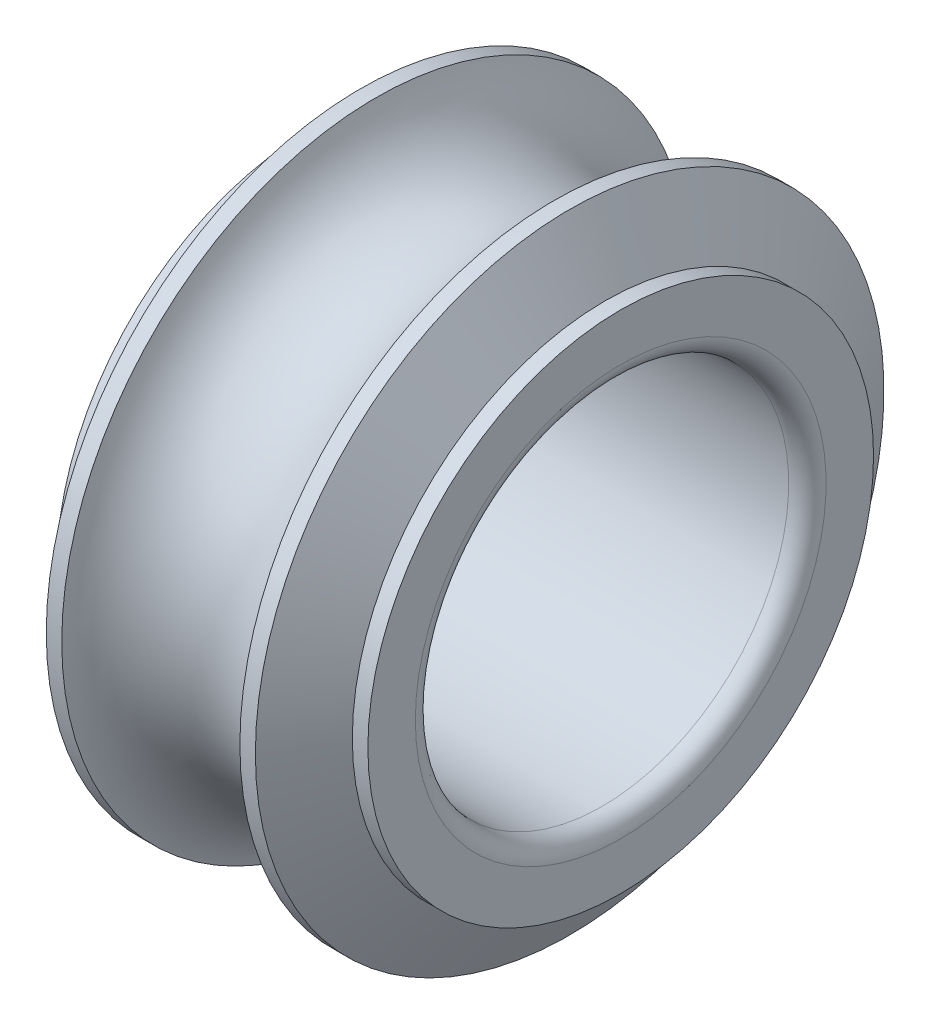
ISO-10303-21;
HEADER;
FILE_DESCRIPTION(('STEP AP214'),'2;1');
FILE_NAME('part.step','',(''),(''),'','','');
FILE_SCHEMA(('AUTOMOTIVE_DESIGN { 1 0 10303 214 1 1 1 1 }'));
ENDSEC;
DATA;
#1=APPLICATION_CONTEXT('core data for automotive mechanical design processes');
#2=APPLICATION_PROTOCOL_DEFINITION('international standard','automotive_design',2000,#1);
#3=PRODUCT_CONTEXT('',#1,'mechanical');
#4=PRODUCT('Part','Part','',(#3));
#5=PRODUCT_RELATED_PRODUCT_CATEGORY('part','',(#4));
#6=PRODUCT_DEFINITION_FORMATION('','',#4);
#7=PRODUCT_DEFINITION_CONTEXT('part definition',#1,'design');
#8=PRODUCT_DEFINITION('design','',#6,#7);
#9=PRODUCT_DEFINITION_SHAPE('','',#8);
#10=(LENGTH_UNIT() NAMED_UNIT(*) SI_UNIT(.MILLI.,.METRE.));
#11=(NAMED_UNIT(*) PLANE_ANGLE_UNIT() SI_UNIT($,.RADIAN.));
#12=(NAMED_UNIT(*) SI_UNIT($,.STERADIAN.) SOLID_ANGLE_UNIT());
#13=UNCERTAINTY_MEASURE_WITH_UNIT(LENGTH_MEASURE(1.E-05),#10,'distance_accuracy_value','');
#14=(GEOMETRIC_REPRESENTATION_CONTEXT(3) GLOBAL_UNCERTAINTY_ASSIGNED_CONTEXT((#13)) GLOBAL_UNIT_ASSIGNED_CONTEXT((#10,
#11,#12)) REPRESENTATION_CONTEXT('',''));
#15=CARTESIAN_POINT('',(0.,0.,0.));
#16=DIRECTION('',(0.,0.,1.));
#17=DIRECTION('',(1.,0.,0.));
#18=AXIS2_PLACEMENT_3D('',#15,#16,#17);
#19=CARTESIAN_POINT('',(9.4,0.,0.));
#20=DIRECTION('',(-1.,0.,0.));
#21=DIRECTION('',(0.,0.,1.));
#22=AXIS2_PLACEMENT_3D('',#19,#20,#21);
#23=TOROIDAL_SURFACE('',#22,6.6,0.6);
#24=CARTESIAN_POINT('',(10.,0.,0.));
#25=DIRECTION('',(-1.,0.,0.));
#26=DIRECTION('',(0.,0.,1.));
#27=AXIS2_PLACEMENT_3D('',#24,#25,#26);
#28=CIRCLE('',#27,6.6);
#29=CARTESIAN_POINT('',(10.,0.,6.6));
#30=VERTEX_POINT('',#29);
#31=EDGE_CURVE('E10',#30,#30,#28,.T.);
#32=ORIENTED_EDGE('',*,*,#31,.F.);
#33=EDGE_LOOP('',(#32));
#34=FACE_BOUND('',#33,.T.);
#35=CARTESIAN_POINT('',(9.4,0.,0.));
#36=DIRECTION('',(-1.,0.,0.));
#37=DIRECTION('',(0.,0.,1.));
#38=AXIS2_PLACEMENT_3D('',#35,#36,#37);
#39=CIRCLE('',#38,6.);
#40=CARTESIAN_POINT('',(9.4,0.,6.));
#41=VERTEX_POINT('',#40);
#42=EDGE_CURVE('E72',#41,#41,#39,.T.);
#43=ORIENTED_EDGE('',*,*,#42,.T.);
#44=EDGE_LOOP('',(#43));
#45=FACE_BOUND('',#44,.T.);
#46=ADVANCED_FACE('F14',(#34,#45),#23,.T.);
#47=CARTESIAN_POINT('',(10.,6.6,0.));
#48=DIRECTION('',(-1.,0.,0.));
#49=DIRECTION('',(0.,0.,1.));
#50=AXIS2_PLACEMENT_3D('',#47,#48,#49);
#51=PLANE('',#50);
#52=CARTESIAN_POINT('',(10.,0.,0.));
#53=DIRECTION('',(-1.,0.,0.));
#54=DIRECTION('',(0.,0.,1.));
#55=AXIS2_PLACEMENT_3D('',#52,#53,#54);
#56=CIRCLE('',#55,8.125);
#57=CARTESIAN_POINT('',(10.,0.,8.125));
#58=VERTEX_POINT('',#57);
#59=EDGE_CURVE('E21',#58,#58,#56,.T.);
#60=ORIENTED_EDGE('',*,*,#59,.F.);
#61=EDGE_LOOP('',(#60));
#62=FACE_BOUND('',#61,.T.);
#63=ORIENTED_EDGE('',*,*,#31,.T.);
#64=EDGE_LOOP('',(#63));
#65=FACE_BOUND('',#64,.T.);
#66=ADVANCED_FACE('F127',(#62,#65),#51,.F.);
#67=CARTESIAN_POINT('',(0.,0.,0.));
#68=DIRECTION('',(-1.,0.,0.));
#69=DIRECTION('',(0.,0.,1.));
#70=AXIS2_PLACEMENT_3D('',#67,#68,#69);
#71=CYLINDRICAL_SURFACE('',#70,8.125);
#72=CARTESIAN_POINT('',(9.5,0.,0.));
#73=DIRECTION('',(-1.,0.,0.));
#74=DIRECTION('',(0.,0.,1.));
#75=AXIS2_PLACEMENT_3D('',#72,#73,#74);
#76=CIRCLE('',#75,8.125);
#77=CARTESIAN_POINT('',(9.5,0.,8.125));
#78=VERTEX_POINT('',#77);
#79=EDGE_CURVE('E30',#78,#78,#76,.T.);
#80=ORIENTED_EDGE('',*,*,#79,.F.);
#81=EDGE_LOOP('',(#80));
#82=FACE_BOUND('',#81,.T.);
#83=ORIENTED_EDGE('',*,*,#59,.T.);
#84=EDGE_LOOP('',(#83));
#85=FACE_BOUND('',#84,.T.);
#86=ADVANCED_FACE('F132',(#82,#85),#71,.T.);
#87=CARTESIAN_POINT('',(9.5,0.,0.));
#88=DIRECTION('',(-1.,0.,0.));
#89=DIRECTION('',(0.,0.,1.));
#90=AXIS2_PLACEMENT_3D('',#87,#88,#89);
#91=CONICAL_SURFACE('',#90,8.125,1.0471975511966);
#92=CARTESIAN_POINT('',(8.35973321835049,0.,0.));
#93=DIRECTION('',(-1.,0.,0.));
#94=DIRECTION('',(0.,0.,1.));
#95=AXIS2_PLACEMENT_3D('',#92,#93,#94);
#96=CIRCLE('',#95,10.1);
#97=CARTESIAN_POINT('',(8.35973321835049,0.,10.1));
#98=VERTEX_POINT('',#97);
#99=EDGE_CURVE('E38',#98,#98,#96,.T.);
#100=ORIENTED_EDGE('',*,*,#99,.F.);
#101=EDGE_LOOP('',(#100));
#102=FACE_BOUND('',#101,.T.);
#103=ORIENTED_EDGE('',*,*,#79,.T.);
#104=EDGE_LOOP('',(#103));
#105=FACE_BOUND('',#104,.T.);
#106=ADVANCED_FACE('F123',(#102,#105),#91,.T.);
#107=CARTESIAN_POINT('',(0.,0.,0.));
#108=DIRECTION('',(-1.,0.,0.));
#109=DIRECTION('',(0.,0.,1.));
#110=AXIS2_PLACEMENT_3D('',#107,#108,#109);
#111=CYLINDRICAL_SURFACE('',#110,10.1);
#112=CARTESIAN_POINT('',(7.86181760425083,0.,0.));
#113=DIRECTION('',(-1.,0.,0.));
#114=DIRECTION('',(0.,0.,1.));
#115=AXIS2_PLACEMENT_3D('',#112,#113,#114);
#116=CIRCLE('',#115,10.1);
#117=CARTESIAN_POINT('',(7.86181760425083,0.,10.1));
#118=VERTEX_POINT('',#117);
#119=EDGE_CURVE('E44',#118,#118,#116,.T.);
#120=ORIENTED_EDGE('',*,*,#119,.F.);
#121=EDGE_LOOP('',(#120));
#122=FACE_BOUND('',#121,.T.);
#123=ORIENTED_EDGE('',*,*,#99,.T.);
#124=EDGE_LOOP('',(#123));
#125=FACE_BOUND('',#124,.T.);
#126=ADVANCED_FACE('F116',(#122,#125),#111,.T.);
#127=CARTESIAN_POINT('',(5.,0.,0.));
#128=DIRECTION('',(-1.,0.,0.));
#129=DIRECTION('',(0.,0.,1.));
#130=AXIS2_PLACEMENT_3D('',#127,#128,#129);
#131=TOROIDAL_SURFACE('',#130,11.,3.);
#132=ORIENTED_EDGE('',*,*,#119,.T.);
#133=EDGE_LOOP('',(#132));
#134=FACE_BOUND('',#133,.T.);
#135=CARTESIAN_POINT('',(2.13818239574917,0.,0.));
#136=DIRECTION('',(-1.,0.,0.));
#137=DIRECTION('',(0.,0.,1.));
#138=AXIS2_PLACEMENT_3D('',#135,#136,#137);
#139=CIRCLE('',#138,10.1);
#140=CARTESIAN_POINT('',(2.13818239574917,0.,10.1));
#141=VERTEX_POINT('',#140);
#142=EDGE_CURVE('E48',#141,#141,#139,.T.);
#143=ORIENTED_EDGE('',*,*,#142,.F.);
#144=EDGE_LOOP('',(#143));
#145=FACE_BOUND('',#144,.T.);
#146=ADVANCED_FACE('F111',(#134,#145),#131,.F.);
#147=CARTESIAN_POINT('',(0.,0.,0.));
#148=DIRECTION('',(-1.,0.,0.));
#149=DIRECTION('',(0.,0.,1.));
#150=AXIS2_PLACEMENT_3D('',#147,#148,#149);
#151=CYLINDRICAL_SURFACE('',#150,10.1);
#152=CARTESIAN_POINT('',(1.64026678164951,0.,0.));
#153=DIRECTION('',(-1.,0.,0.));
#154=DIRECTION('',(0.,0.,1.));
#155=AXIS2_PLACEMENT_3D('',#152,#153,#154);
#156=CIRCLE('',#155,10.1);
#157=CARTESIAN_POINT('',(1.64026678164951,0.,10.1));
#158=VERTEX_POINT('',#157);
#159=EDGE_CURVE('E52',#158,#158,#156,.T.);
#160=ORIENTED_EDGE('',*,*,#159,.F.);
#161=EDGE_LOOP('',(#160));
#162=FACE_BOUND('',#161,.T.);
#163=ORIENTED_EDGE('',*,*,#142,.T.);
#164=EDGE_LOOP('',(#163));
#165=FACE_BOUND('',#164,.T.);
#166=ADVANCED_FACE('F105',(#162,#165),#151,.T.);
#167=CARTESIAN_POINT('',(1.64026678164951,0.,0.));
#168=DIRECTION('',(1.,0.,0.));
#169=DIRECTION('',(0.,0.,-1.));
#170=AXIS2_PLACEMENT_3D('',#167,#168,#169);
#171=CONICAL_SURFACE('',#170,10.1,1.0471975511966);
#172=CARTESIAN_POINT('',(0.5,0.,0.));
#173=DIRECTION('',(-1.,0.,0.));
#174=DIRECTION('',(0.,0.,1.));
#175=AXIS2_PLACEMENT_3D('',#172,#173,#174);
#176=CIRCLE('',#175,8.125);
#177=CARTESIAN_POINT('',(0.5,0.,8.125));
#178=VERTEX_POINT('',#177);
#179=EDGE_CURVE('E56',#178,#178,#176,.T.);
#180=ORIENTED_EDGE('',*,*,#179,.F.);
#181=EDGE_LOOP('',(#180));
#182=FACE_BOUND('',#181,.T.);
#183=ORIENTED_EDGE('',*,*,#159,.T.);
#184=EDGE_LOOP('',(#183));
#185=FACE_BOUND('',#184,.T.);
#186=ADVANCED_FACE('F99',(#182,#185),#171,.T.);
#187=CARTESIAN_POINT('',(0.,0.,0.));
#188=DIRECTION('',(-1.,0.,0.));
#189=DIRECTION('',(0.,0.,1.));
#190=AXIS2_PLACEMENT_3D('',#187,#188,#189);
#191=CYLINDRICAL_SURFACE('',#190,8.125);
#192=CARTESIAN_POINT('',(0.,0.,0.));
#193=DIRECTION('',(-1.,0.,0.));
#194=DIRECTION('',(0.,0.,1.));
#195=AXIS2_PLACEMENT_3D('',#192,#193,#194);
#196=CIRCLE('',#195,8.125);
#197=CARTESIAN_POINT('',(0.,0.,8.125));
#198=VERTEX_POINT('',#197);
#199=EDGE_CURVE('E60',#198,#198,#196,.T.);
#200=ORIENTED_EDGE('',*,*,#199,.F.);
#201=EDGE_LOOP('',(#200));
#202=FACE_BOUND('',#201,.T.);
#203=ORIENTED_EDGE('',*,*,#179,.T.);
#204=EDGE_LOOP('',(#203));
#205=FACE_BOUND('',#204,.T.);
#206=ADVANCED_FACE('F93',(#202,#205),#191,.T.);
#207=CARTESIAN_POINT('',(0.,8.125,0.));
#208=DIRECTION('',(1.,0.,0.));
#209=DIRECTION('',(0.,0.,-1.));
#210=AXIS2_PLACEMENT_3D('',#207,#208,#209);
#211=PLANE('',#210);
#212=CARTESIAN_POINT('',(0.,0.,0.));
#213=DIRECTION('',(-1.,0.,0.));
#214=DIRECTION('',(0.,0.,1.));
#215=AXIS2_PLACEMENT_3D('',#212,#213,#214);
#216=CIRCLE('',#215,6.6);
#217=CARTESIAN_POINT('',(0.,0.,6.6));
#218=VERTEX_POINT('',#217);
#219=EDGE_CURVE('E64',#218,#218,#216,.T.);
#220=ORIENTED_EDGE('',*,*,#219,.F.);
#221=EDGE_LOOP('',(#220));
#222=FACE_BOUND('',#221,.T.);
#223=ORIENTED_EDGE('',*,*,#199,.T.);
#224=EDGE_LOOP('',(#223));
#225=FACE_BOUND('',#224,.T.);
#226=ADVANCED_FACE('F87',(#222,#225),#211,.F.);
#227=CARTESIAN_POINT('',(0.6,0.,0.));
#228=DIRECTION('',(-1.,0.,0.));
#229=DIRECTION('',(0.,0.,1.));
#230=AXIS2_PLACEMENT_3D('',#227,#228,#229);
#231=TOROIDAL_SURFACE('',#230,6.6,0.6);
#232=CARTESIAN_POINT('',(0.6,0.,0.));
#233=DIRECTION('',(-1.,0.,0.));
#234=DIRECTION('',(0.,0.,1.));
#235=AXIS2_PLACEMENT_3D('',#232,#233,#234);
#236=CIRCLE('',#235,6.);
#237=CARTESIAN_POINT('',(0.6,0.,6.));
#238=VERTEX_POINT('',#237);
#239=EDGE_CURVE('E68',#238,#238,#236,.T.);
#240=ORIENTED_EDGE('',*,*,#239,.F.);
#241=EDGE_LOOP('',(#240));
#242=FACE_BOUND('',#241,.T.);
#243=ORIENTED_EDGE('',*,*,#219,.T.);
#244=EDGE_LOOP('',(#243));
#245=FACE_BOUND('',#244,.T.);
#246=ADVANCED_FACE('F81',(#242,#245),#231,.T.);
#247=CARTESIAN_POINT('',(0.,0.,0.));
#248=DIRECTION('',(-1.,0.,0.));
#249=DIRECTION('',(0.,0.,1.));
#250=AXIS2_PLACEMENT_3D('',#247,#248,#249);
#251=CYLINDRICAL_SURFACE('',#250,6.);
#252=ORIENTED_EDGE('',*,*,#42,.F.);
#253=EDGE_LOOP('',(#252));
#254=FACE_BOUND('',#253,.T.);
#255=ORIENTED_EDGE('',*,*,#239,.T.);
#256=EDGE_LOOP('',(#255));
#257=FACE_BOUND('',#256,.T.);
#258=ADVANCED_FACE('F78',(#254,#257),#251,.F.);
#259=CLOSED_SHELL('',(#46,#66,#86,#106,#126,#146,#166,#186,#206,#226,#246,#258));
#260=MANIFOLD_SOLID_BREP('B1',#259);
#261=ADVANCED_BREP_SHAPE_REPRESENTATION('',(#18,#260),#14);
#262=SHAPE_DEFINITION_REPRESENTATION(#9,#261);
ENDSEC;
END-ISO-10303-21;
